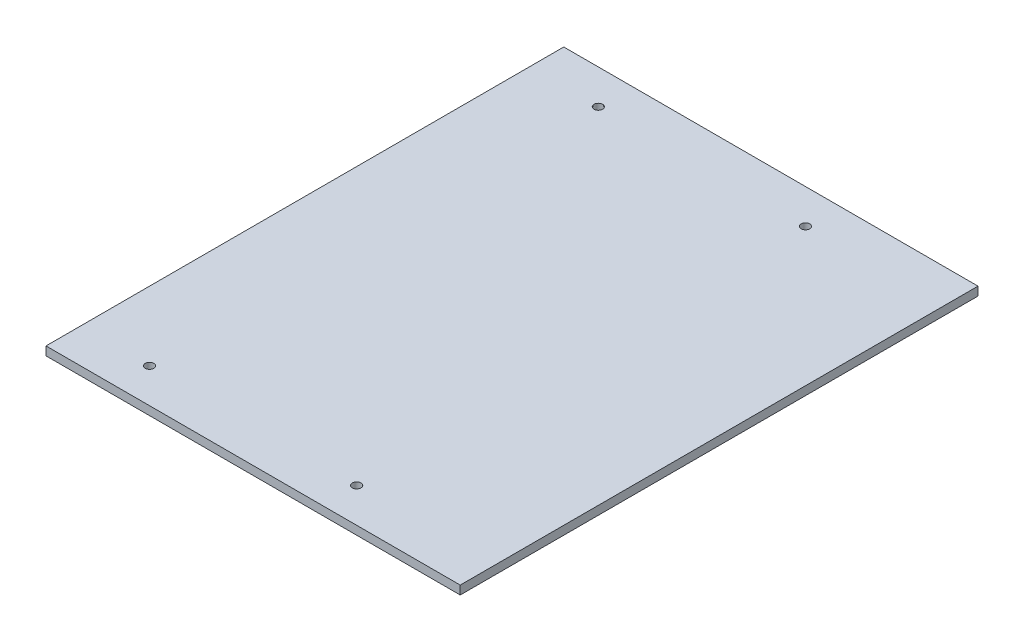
from build123d import *

# Parameters (mm, degrees)
SKETCH_1_W      = 152.4
SKETCH_1_H      = 190.5
SKETCH_1_R      = 1.5875
EXTRUDE_1_DEPTH = 3.175


with BuildPart() as part:
    # Sketch 1 → Extrude 1 (new body)
    with BuildSketch(Plane(origin=(0, 0, 0), x_dir=(1, 0, 0), z_dir=(0, 1, 0))):
        with Locations((-25.4, 0)):
            Rectangle(SKETCH_1_W, SKETCH_1_H)
        with Locations(Location((0, -82.55, 0), (0, 0, 270))):
            Circle(SKETCH_1_R, mode=Mode.SUBTRACT)
        with Locations(Location((-76.2, -82.55, 0), (0, 0, 270))):
            Circle(SKETCH_1_R, mode=Mode.SUBTRACT)
        with Locations(Location((-76.2, 82.55, 0), (0, 0, 270))):
            Circle(SKETCH_1_R, mode=Mode.SUBTRACT)
        with Locations(Location((0, 82.55, 0), (0, 0, 270))):
            Circle(SKETCH_1_R, mode=Mode.SUBTRACT)
    extrude(amount=EXTRUDE_1_DEPTH)


solid = part.part
